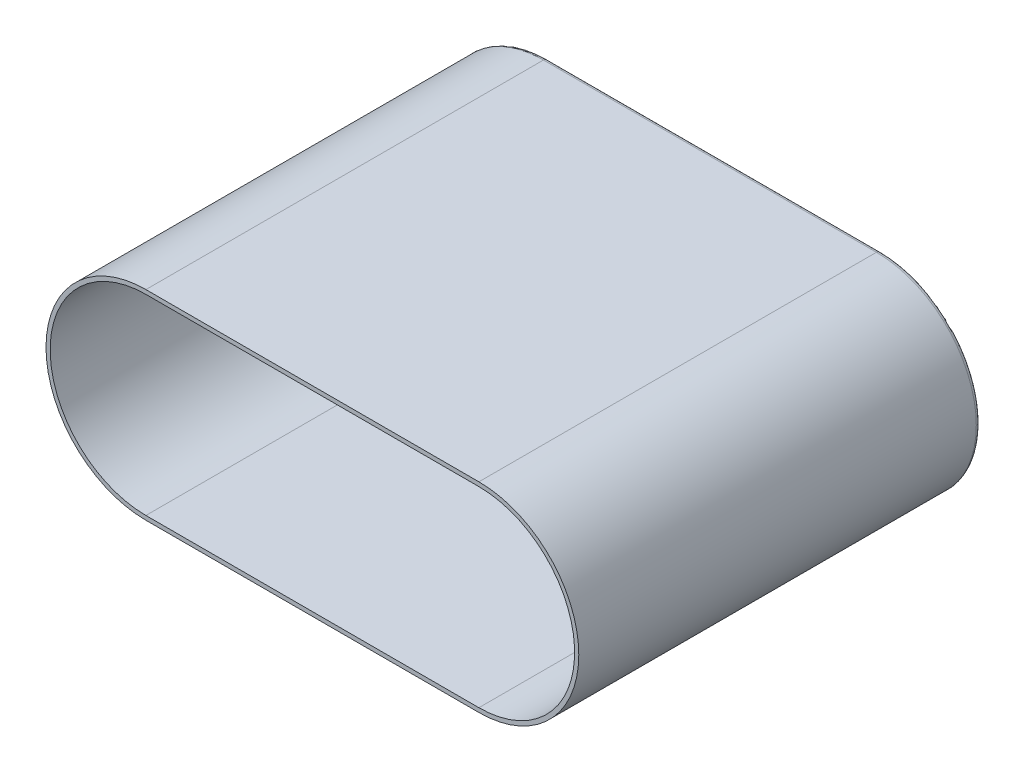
ISO-10303-21;
HEADER;
FILE_DESCRIPTION(('STEP AP214'),'2;1');
FILE_NAME('part.step','',(''),(''),'','','');
FILE_SCHEMA(('AUTOMOTIVE_DESIGN { 1 0 10303 214 1 1 1 1 }'));
ENDSEC;
DATA;
#1=APPLICATION_CONTEXT('core data for automotive mechanical design processes');
#2=APPLICATION_PROTOCOL_DEFINITION('international standard','automotive_design',2000,#1);
#3=PRODUCT_CONTEXT('',#1,'mechanical');
#4=PRODUCT('Part','Part','',(#3));
#5=PRODUCT_RELATED_PRODUCT_CATEGORY('part','',(#4));
#6=PRODUCT_DEFINITION_FORMATION('','',#4);
#7=PRODUCT_DEFINITION_CONTEXT('part definition',#1,'design');
#8=PRODUCT_DEFINITION('design','',#6,#7);
#9=PRODUCT_DEFINITION_SHAPE('','',#8);
#10=(LENGTH_UNIT() NAMED_UNIT(*) SI_UNIT(.MILLI.,.METRE.));
#11=(NAMED_UNIT(*) PLANE_ANGLE_UNIT() SI_UNIT($,.RADIAN.));
#12=(NAMED_UNIT(*) SI_UNIT($,.STERADIAN.) SOLID_ANGLE_UNIT());
#13=UNCERTAINTY_MEASURE_WITH_UNIT(LENGTH_MEASURE(1.E-05),#10,'distance_accuracy_value','');
#14=(GEOMETRIC_REPRESENTATION_CONTEXT(3) GLOBAL_UNCERTAINTY_ASSIGNED_CONTEXT((#13)) GLOBAL_UNIT_ASSIGNED_CONTEXT((#10,
#11,#12)) REPRESENTATION_CONTEXT('',''));
#15=CARTESIAN_POINT('',(0.,0.,0.));
#16=DIRECTION('',(0.,0.,1.));
#17=DIRECTION('',(1.,0.,0.));
#18=AXIS2_PLACEMENT_3D('',#15,#16,#17);
#19=CARTESIAN_POINT('',(-40.,0.,95.));
#20=DIRECTION('',(0.,0.,1.));
#21=DIRECTION('',(1.,0.,0.));
#22=AXIS2_PLACEMENT_3D('',#19,#20,#21);
#23=PLANE('',#22);
#24=CARTESIAN_POINT('',(-40.,0.,95.));
#25=DIRECTION('',(0.,0.,1.));
#26=DIRECTION('',(1.,0.,0.));
#27=AXIS2_PLACEMENT_3D('',#24,#25,#26);
#28=CIRCLE('',#27,24.);
#29=CARTESIAN_POINT('',(-40.,24.,95.));
#30=VERTEX_POINT('',#29);
#31=CARTESIAN_POINT('',(-40.,-24.,95.));
#32=VERTEX_POINT('',#31);
#33=EDGE_CURVE('E149',#30,#32,#28,.T.);
#34=ORIENTED_EDGE('',*,*,#33,.T.);
#35=DIRECTION('',(1.,0.,0.));
#36=VECTOR('',#35,1.);
#37=CARTESIAN_POINT('',(-40.,-24.,95.));
#38=LINE('',#37,#36);
#39=CARTESIAN_POINT('',(40.,-24.,95.));
#40=VERTEX_POINT('',#39);
#41=EDGE_CURVE('E152',#32,#40,#38,.T.);
#42=ORIENTED_EDGE('',*,*,#41,.T.);
#43=CARTESIAN_POINT('',(40.,0.,95.));
#44=DIRECTION('',(0.,0.,1.));
#45=DIRECTION('',(1.,0.,0.));
#46=AXIS2_PLACEMENT_3D('',#43,#44,#45);
#47=CIRCLE('',#46,24.);
#48=CARTESIAN_POINT('',(40.,24.,95.));
#49=VERTEX_POINT('',#48);
#50=EDGE_CURVE('E154',#40,#49,#47,.T.);
#51=ORIENTED_EDGE('',*,*,#50,.T.);
#52=DIRECTION('',(-1.,0.,0.));
#53=VECTOR('',#52,1.);
#54=CARTESIAN_POINT('',(-40.,24.,95.));
#55=LINE('',#54,#53);
#56=EDGE_CURVE('E156',#49,#30,#55,.T.);
#57=ORIENTED_EDGE('',*,*,#56,.T.);
#58=EDGE_LOOP('',(#34,#42,#51,#57));
#59=FACE_BOUND('',#58,.T.);
#60=DIRECTION('',(1.,0.,0.));
#61=VECTOR('',#60,1.);
#62=CARTESIAN_POINT('',(-40.,-23.,95.));
#63=LINE('',#62,#61);
#64=CARTESIAN_POINT('',(-40.,-23.,95.));
#65=VERTEX_POINT('',#64);
#66=CARTESIAN_POINT('',(40.,-23.,95.));
#67=VERTEX_POINT('',#66);
#68=EDGE_CURVE('E140',#65,#67,#63,.T.);
#69=ORIENTED_EDGE('',*,*,#68,.F.);
#70=CARTESIAN_POINT('',(-40.,0.,95.));
#71=DIRECTION('',(0.,0.,1.));
#72=DIRECTION('',(1.,0.,0.));
#73=AXIS2_PLACEMENT_3D('',#70,#71,#72);
#74=CIRCLE('',#73,23.);
#75=CARTESIAN_POINT('',(-40.,23.,95.));
#76=VERTEX_POINT('',#75);
#77=EDGE_CURVE('E138',#76,#65,#74,.T.);
#78=ORIENTED_EDGE('',*,*,#77,.F.);
#79=DIRECTION('',(-1.,0.,0.));
#80=VECTOR('',#79,1.);
#81=CARTESIAN_POINT('',(-40.,23.,95.));
#82=LINE('',#81,#80);
#83=CARTESIAN_POINT('',(40.,23.,95.));
#84=VERTEX_POINT('',#83);
#85=EDGE_CURVE('E120',#84,#76,#82,.T.);
#86=ORIENTED_EDGE('',*,*,#85,.F.);
#87=CARTESIAN_POINT('',(40.,0.,95.));
#88=DIRECTION('',(0.,0.,1.));
#89=DIRECTION('',(1.,0.,0.));
#90=AXIS2_PLACEMENT_3D('',#87,#88,#89);
#91=CIRCLE('',#90,23.);
#92=EDGE_CURVE('E356',#67,#84,#91,.T.);
#93=ORIENTED_EDGE('',*,*,#92,.F.);
#94=EDGE_LOOP('',(#69,#78,#86,#93));
#95=FACE_BOUND('',#94,.T.);
#96=ADVANCED_FACE('F33',(#59,#95),#23,.T.);
#97=CARTESIAN_POINT('',(-40.,0.,95.));
#98=DIRECTION('',(0.,0.,-1.));
#99=DIRECTION('',(-1.,0.,0.));
#100=AXIS2_PLACEMENT_3D('',#97,#98,#99);
#101=CYLINDRICAL_SURFACE('',#100,24.);
#102=DIRECTION('',(0.,0.,-1.));
#103=VECTOR('',#102,1.);
#104=CARTESIAN_POINT('',(-40.,24.,95.));
#105=LINE('',#104,#103);
#106=CARTESIAN_POINT('',(-40.,24.,-0.5));
#107=VERTEX_POINT('',#106);
#108=EDGE_CURVE('E158',#30,#107,#105,.T.);
#109=ORIENTED_EDGE('',*,*,#108,.T.);
#110=CARTESIAN_POINT('',(-40.,0.,-0.5));
#111=DIRECTION('',(0.,0.,-1.));
#112=DIRECTION('',(-1.,0.,0.));
#113=AXIS2_PLACEMENT_3D('',#110,#111,#112);
#114=CIRCLE('',#113,24.);
#115=CARTESIAN_POINT('',(-40.,-24.,-0.5));
#116=VERTEX_POINT('',#115);
#117=EDGE_CURVE('E57',#107,#116,#114,.F.);
#118=ORIENTED_EDGE('',*,*,#117,.T.);
#119=DIRECTION('',(0.,0.,-1.));
#120=VECTOR('',#119,1.);
#121=CARTESIAN_POINT('',(-40.,-24.,95.));
#122=LINE('',#121,#120);
#123=EDGE_CURVE('E165',#32,#116,#122,.T.);
#124=ORIENTED_EDGE('',*,*,#123,.F.);
#125=ORIENTED_EDGE('',*,*,#33,.F.);
#126=EDGE_LOOP('',(#109,#118,#124,#125));
#127=FACE_BOUND('',#126,.T.);
#128=ADVANCED_FACE('F222',(#127),#101,.T.);
#129=CARTESIAN_POINT('',(-40.,-24.,95.));
#130=DIRECTION('',(0.,1.,0.));
#131=DIRECTION('',(0.,0.,1.));
#132=AXIS2_PLACEMENT_3D('',#129,#130,#131);
#133=PLANE('',#132);
#134=ORIENTED_EDGE('',*,*,#123,.T.);
#135=DIRECTION('',(-1.,0.,0.));
#136=VECTOR('',#135,1.);
#137=CARTESIAN_POINT('',(40.,-24.,-0.5));
#138=LINE('',#137,#136);
#139=CARTESIAN_POINT('',(40.,-24.,-0.5));
#140=VERTEX_POINT('',#139);
#141=EDGE_CURVE('E42',#116,#140,#138,.F.);
#142=ORIENTED_EDGE('',*,*,#141,.T.);
#143=DIRECTION('',(0.,0.,-1.));
#144=VECTOR('',#143,1.);
#145=CARTESIAN_POINT('',(40.,-24.,95.));
#146=LINE('',#145,#144);
#147=EDGE_CURVE('E163',#40,#140,#146,.T.);
#148=ORIENTED_EDGE('',*,*,#147,.F.);
#149=ORIENTED_EDGE('',*,*,#41,.F.);
#150=EDGE_LOOP('',(#134,#142,#148,#149));
#151=FACE_BOUND('',#150,.T.);
#152=ADVANCED_FACE('F228',(#151),#133,.F.);
#153=CARTESIAN_POINT('',(40.,0.,95.));
#154=DIRECTION('',(0.,0.,-1.));
#155=DIRECTION('',(-1.,0.,0.));
#156=AXIS2_PLACEMENT_3D('',#153,#154,#155);
#157=CYLINDRICAL_SURFACE('',#156,24.);
#158=ORIENTED_EDGE('',*,*,#147,.T.);
#159=CARTESIAN_POINT('',(40.,0.,-0.5));
#160=DIRECTION('',(0.,0.,-1.));
#161=DIRECTION('',(-1.,0.,0.));
#162=AXIS2_PLACEMENT_3D('',#159,#160,#161);
#163=CIRCLE('',#162,24.);
#164=CARTESIAN_POINT('',(40.,24.,-0.5));
#165=VERTEX_POINT('',#164);
#166=EDGE_CURVE('E11',#140,#165,#163,.F.);
#167=ORIENTED_EDGE('',*,*,#166,.T.);
#168=DIRECTION('',(0.,0.,-1.));
#169=VECTOR('',#168,1.);
#170=CARTESIAN_POINT('',(40.,24.,95.));
#171=LINE('',#170,#169);
#172=EDGE_CURVE('E160',#49,#165,#171,.T.);
#173=ORIENTED_EDGE('',*,*,#172,.F.);
#174=ORIENTED_EDGE('',*,*,#50,.F.);
#175=EDGE_LOOP('',(#158,#167,#173,#174));
#176=FACE_BOUND('',#175,.T.);
#177=ADVANCED_FACE('F202',(#176),#157,.T.);
#178=CARTESIAN_POINT('',(-40.,24.,95.));
#179=DIRECTION('',(0.,-1.,0.));
#180=DIRECTION('',(0.,0.,-1.));
#181=AXIS2_PLACEMENT_3D('',#178,#179,#180);
#182=PLANE('',#181);
#183=ORIENTED_EDGE('',*,*,#172,.T.);
#184=DIRECTION('',(1.,0.,0.));
#185=VECTOR('',#184,1.);
#186=CARTESIAN_POINT('',(-40.,24.,-0.5));
#187=LINE('',#186,#185);
#188=EDGE_CURVE('E176',#165,#107,#187,.F.);
#189=ORIENTED_EDGE('',*,*,#188,.T.);
#190=ORIENTED_EDGE('',*,*,#108,.F.);
#191=ORIENTED_EDGE('',*,*,#56,.F.);
#192=EDGE_LOOP('',(#183,#189,#190,#191));
#193=FACE_BOUND('',#192,.T.);
#194=ADVANCED_FACE('F207',(#193),#182,.F.);
#195=CARTESIAN_POINT('',(-40.,0.,95.));
#196=DIRECTION('',(0.,0.,-1.));
#197=DIRECTION('',(-1.,0.,0.));
#198=AXIS2_PLACEMENT_3D('',#195,#196,#197);
#199=CYLINDRICAL_SURFACE('',#198,23.);
#200=CARTESIAN_POINT('',(-40.,0.,0.));
#201=DIRECTION('',(0.,0.,1.));
#202=DIRECTION('',(1.,0.,0.));
#203=AXIS2_PLACEMENT_3D('',#200,#201,#202);
#204=CIRCLE('',#203,23.);
#205=CARTESIAN_POINT('',(-40.,23.,0.));
#206=VERTEX_POINT('',#205);
#207=CARTESIAN_POINT('',(-40.,-23.,0.));
#208=VERTEX_POINT('',#207);
#209=EDGE_CURVE('E127',#206,#208,#204,.T.);
#210=ORIENTED_EDGE('',*,*,#209,.F.);
#211=DIRECTION('',(0.,0.,-1.));
#212=VECTOR('',#211,1.);
#213=CARTESIAN_POINT('',(-40.,23.,95.));
#214=LINE('',#213,#212);
#215=EDGE_CURVE('E113',#76,#206,#214,.T.);
#216=ORIENTED_EDGE('',*,*,#215,.F.);
#217=ORIENTED_EDGE('',*,*,#77,.T.);
#218=DIRECTION('',(0.,0.,-1.));
#219=VECTOR('',#218,1.);
#220=CARTESIAN_POINT('',(-40.,-23.,95.));
#221=LINE('',#220,#219);
#222=EDGE_CURVE('E130',#65,#208,#221,.T.);
#223=ORIENTED_EDGE('',*,*,#222,.T.);
#224=EDGE_LOOP('',(#210,#216,#217,#223));
#225=FACE_BOUND('',#224,.T.);
#226=ADVANCED_FACE('F128',(#225),#199,.F.);
#227=CARTESIAN_POINT('',(-40.,-23.,95.));
#228=DIRECTION('',(0.,1.,0.));
#229=DIRECTION('',(0.,0.,1.));
#230=AXIS2_PLACEMENT_3D('',#227,#228,#229);
#231=PLANE('',#230);
#232=DIRECTION('',(1.,0.,0.));
#233=VECTOR('',#232,1.);
#234=CARTESIAN_POINT('',(-40.,-23.,0.));
#235=LINE('',#234,#233);
#236=CARTESIAN_POINT('',(40.,-23.,0.));
#237=VERTEX_POINT('',#236);
#238=EDGE_CURVE('E133',#208,#237,#235,.T.);
#239=ORIENTED_EDGE('',*,*,#238,.F.);
#240=ORIENTED_EDGE('',*,*,#222,.F.);
#241=ORIENTED_EDGE('',*,*,#68,.T.);
#242=DIRECTION('',(0.,0.,-1.));
#243=VECTOR('',#242,1.);
#244=CARTESIAN_POINT('',(40.,-23.,95.));
#245=LINE('',#244,#243);
#246=EDGE_CURVE('E146',#67,#237,#245,.T.);
#247=ORIENTED_EDGE('',*,*,#246,.T.);
#248=EDGE_LOOP('',(#239,#240,#241,#247));
#249=FACE_BOUND('',#248,.T.);
#250=ADVANCED_FACE('F325',(#249),#231,.T.);
#251=CARTESIAN_POINT('',(40.,0.,95.));
#252=DIRECTION('',(0.,0.,-1.));
#253=DIRECTION('',(-1.,0.,0.));
#254=AXIS2_PLACEMENT_3D('',#251,#252,#253);
#255=CYLINDRICAL_SURFACE('',#254,23.);
#256=CARTESIAN_POINT('',(40.,0.,0.));
#257=DIRECTION('',(0.,0.,1.));
#258=DIRECTION('',(1.,0.,0.));
#259=AXIS2_PLACEMENT_3D('',#256,#257,#258);
#260=CIRCLE('',#259,23.);
#261=CARTESIAN_POINT('',(40.,23.,0.));
#262=VERTEX_POINT('',#261);
#263=EDGE_CURVE('E137',#237,#262,#260,.T.);
#264=ORIENTED_EDGE('',*,*,#263,.F.);
#265=ORIENTED_EDGE('',*,*,#246,.F.);
#266=ORIENTED_EDGE('',*,*,#92,.T.);
#267=DIRECTION('',(0.,0.,-1.));
#268=VECTOR('',#267,1.);
#269=CARTESIAN_POINT('',(40.,23.,95.));
#270=LINE('',#269,#268);
#271=EDGE_CURVE('E123',#84,#262,#270,.T.);
#272=ORIENTED_EDGE('',*,*,#271,.T.);
#273=EDGE_LOOP('',(#264,#265,#266,#272));
#274=FACE_BOUND('',#273,.T.);
#275=ADVANCED_FACE('F317',(#274),#255,.F.);
#276=CARTESIAN_POINT('',(-40.,23.,95.));
#277=DIRECTION('',(0.,-1.,0.));
#278=DIRECTION('',(0.,0.,-1.));
#279=AXIS2_PLACEMENT_3D('',#276,#277,#278);
#280=PLANE('',#279);
#281=DIRECTION('',(-1.,0.,0.));
#282=VECTOR('',#281,1.);
#283=CARTESIAN_POINT('',(-40.,23.,0.));
#284=LINE('',#283,#282);
#285=EDGE_CURVE('E117',#262,#206,#284,.T.);
#286=ORIENTED_EDGE('',*,*,#285,.F.);
#287=ORIENTED_EDGE('',*,*,#271,.F.);
#288=ORIENTED_EDGE('',*,*,#85,.T.);
#289=ORIENTED_EDGE('',*,*,#215,.T.);
#290=EDGE_LOOP('',(#286,#287,#288,#289));
#291=FACE_BOUND('',#290,.T.);
#292=ADVANCED_FACE('F115',(#291),#280,.T.);
#293=CARTESIAN_POINT('',(40.,0.,0.));
#294=DIRECTION('',(0.,0.,-1.));
#295=DIRECTION('',(-1.,0.,0.));
#296=AXIS2_PLACEMENT_3D('',#293,#294,#295);
#297=PLANE('',#296);
#298=ORIENTED_EDGE('',*,*,#285,.T.);
#299=ORIENTED_EDGE('',*,*,#209,.T.);
#300=ORIENTED_EDGE('',*,*,#238,.T.);
#301=ORIENTED_EDGE('',*,*,#263,.T.);
#302=EDGE_LOOP('',(#298,#299,#300,#301));
#303=FACE_BOUND('',#302,.T.);
#304=ADVANCED_FACE('F135',(#303),#297,.F.);
#305=CARTESIAN_POINT('',(40.,0.,-1.5));
#306=DIRECTION('',(0.,0.,-1.));
#307=DIRECTION('',(-1.,0.,0.));
#308=AXIS2_PLACEMENT_3D('',#305,#306,#307);
#309=PLANE('',#308);
#310=CARTESIAN_POINT('',(-40.,0.,-1.5));
#311=DIRECTION('',(0.,0.,-1.));
#312=DIRECTION('',(-1.,0.,0.));
#313=AXIS2_PLACEMENT_3D('',#310,#311,#312);
#314=CIRCLE('',#313,23.);
#315=CARTESIAN_POINT('',(-40.,-23.,-1.5));
#316=VERTEX_POINT('',#315);
#317=CARTESIAN_POINT('',(-40.,23.,-1.5));
#318=VERTEX_POINT('',#317);
#319=EDGE_CURVE('E171',#316,#318,#314,.T.);
#320=ORIENTED_EDGE('',*,*,#319,.T.);
#321=DIRECTION('',(1.,0.,0.));
#322=VECTOR('',#321,1.);
#323=CARTESIAN_POINT('',(40.,23.,-1.5));
#324=LINE('',#323,#322);
#325=CARTESIAN_POINT('',(40.,23.,-1.5));
#326=VERTEX_POINT('',#325);
#327=EDGE_CURVE('E173',#318,#326,#324,.T.);
#328=ORIENTED_EDGE('',*,*,#327,.T.);
#329=CARTESIAN_POINT('',(40.,0.,-1.5));
#330=DIRECTION('',(0.,0.,-1.));
#331=DIRECTION('',(-1.,0.,0.));
#332=AXIS2_PLACEMENT_3D('',#329,#330,#331);
#333=CIRCLE('',#332,23.);
#334=CARTESIAN_POINT('',(40.,-23.,-1.5));
#335=VERTEX_POINT('',#334);
#336=EDGE_CURVE('E167',#326,#335,#333,.T.);
#337=ORIENTED_EDGE('',*,*,#336,.T.);
#338=DIRECTION('',(-1.,0.,0.));
#339=VECTOR('',#338,1.);
#340=CARTESIAN_POINT('',(-40.,-23.,-1.5));
#341=LINE('',#340,#339);
#342=EDGE_CURVE('E169',#335,#316,#341,.T.);
#343=ORIENTED_EDGE('',*,*,#342,.T.);
#344=EDGE_LOOP('',(#320,#328,#337,#343));
#345=FACE_BOUND('',#344,.T.);
#346=ADVANCED_FACE('F213',(#345),#309,.T.);
#347=CARTESIAN_POINT('',(40.,-23.,-0.5));
#348=DIRECTION('',(1.,0.,0.));
#349=DIRECTION('',(0.,0.,-1.));
#350=AXIS2_PLACEMENT_3D('',#347,#348,#349);
#351=CYLINDRICAL_SURFACE('',#350,1.);
#352=CARTESIAN_POINT('',(40.,-23.,-0.5));
#353=DIRECTION('',(1.,0.,0.));
#354=DIRECTION('',(0.,0.,-1.));
#355=AXIS2_PLACEMENT_3D('',#352,#353,#354);
#356=CIRCLE('',#355,1.);
#357=EDGE_CURVE('E184',#140,#335,#356,.T.);
#358=ORIENTED_EDGE('',*,*,#357,.F.);
#359=ORIENTED_EDGE('',*,*,#141,.F.);
#360=CARTESIAN_POINT('',(-40.,-23.,-0.5));
#361=DIRECTION('',(-1.,0.,0.));
#362=DIRECTION('',(0.,0.,1.));
#363=AXIS2_PLACEMENT_3D('',#360,#361,#362);
#364=CIRCLE('',#363,1.);
#365=EDGE_CURVE('E37',#316,#116,#364,.T.);
#366=ORIENTED_EDGE('',*,*,#365,.F.);
#367=ORIENTED_EDGE('',*,*,#342,.F.);
#368=EDGE_LOOP('',(#358,#359,#366,#367));
#369=FACE_BOUND('',#368,.T.);
#370=ADVANCED_FACE('F35',(#369),#351,.T.);
#371=CARTESIAN_POINT('',(-40.,0.,-0.5));
#372=DIRECTION('',(0.,0.,-1.));
#373=DIRECTION('',(-1.,0.,0.));
#374=AXIS2_PLACEMENT_3D('',#371,#372,#373);
#375=TOROIDAL_SURFACE('',#374,23.,1.);
#376=ORIENTED_EDGE('',*,*,#365,.T.);
#377=ORIENTED_EDGE('',*,*,#117,.F.);
#378=CARTESIAN_POINT('',(-40.,23.,-0.5));
#379=DIRECTION('',(1.,0.,0.));
#380=DIRECTION('',(0.,0.,-1.));
#381=AXIS2_PLACEMENT_3D('',#378,#379,#380);
#382=CIRCLE('',#381,1.);
#383=EDGE_CURVE('E183',#318,#107,#382,.T.);
#384=ORIENTED_EDGE('',*,*,#383,.F.);
#385=ORIENTED_EDGE('',*,*,#319,.F.);
#386=EDGE_LOOP('',(#376,#377,#384,#385));
#387=FACE_BOUND('',#386,.T.);
#388=ADVANCED_FACE('F194',(#387),#375,.T.);
#389=CARTESIAN_POINT('',(40.,0.,-0.5));
#390=DIRECTION('',(0.,0.,-1.));
#391=DIRECTION('',(-1.,0.,0.));
#392=AXIS2_PLACEMENT_3D('',#389,#390,#391);
#393=TOROIDAL_SURFACE('',#392,23.,1.);
#394=ORIENTED_EDGE('',*,*,#357,.T.);
#395=ORIENTED_EDGE('',*,*,#336,.F.);
#396=CARTESIAN_POINT('',(40.,23.,-0.5));
#397=DIRECTION('',(-1.,0.,0.));
#398=DIRECTION('',(0.,0.,1.));
#399=AXIS2_PLACEMENT_3D('',#396,#397,#398);
#400=CIRCLE('',#399,1.);
#401=EDGE_CURVE('E181',#165,#326,#400,.T.);
#402=ORIENTED_EDGE('',*,*,#401,.F.);
#403=ORIENTED_EDGE('',*,*,#166,.F.);
#404=EDGE_LOOP('',(#394,#395,#402,#403));
#405=FACE_BOUND('',#404,.T.);
#406=ADVANCED_FACE('F199',(#405),#393,.T.);
#407=CARTESIAN_POINT('',(40.,23.,-0.5));
#408=DIRECTION('',(-1.,0.,0.));
#409=DIRECTION('',(0.,0.,1.));
#410=AXIS2_PLACEMENT_3D('',#407,#408,#409);
#411=CYLINDRICAL_SURFACE('',#410,1.);
#412=ORIENTED_EDGE('',*,*,#383,.T.);
#413=ORIENTED_EDGE('',*,*,#188,.F.);
#414=ORIENTED_EDGE('',*,*,#401,.T.);
#415=ORIENTED_EDGE('',*,*,#327,.F.);
#416=EDGE_LOOP('',(#412,#413,#414,#415));
#417=FACE_BOUND('',#416,.T.);
#418=ADVANCED_FACE('F210',(#417),#411,.T.);
#419=CLOSED_SHELL('',(#96,#128,#152,#177,#194,#226,#250,#275,#292,#304,#346,#370,#388,#406,#418));
#420=MANIFOLD_SOLID_BREP('B2',#419);
#421=ADVANCED_BREP_SHAPE_REPRESENTATION('',(#18,#420),#14);
#422=SHAPE_DEFINITION_REPRESENTATION(#9,#421);
ENDSEC;
END-ISO-10303-21;
